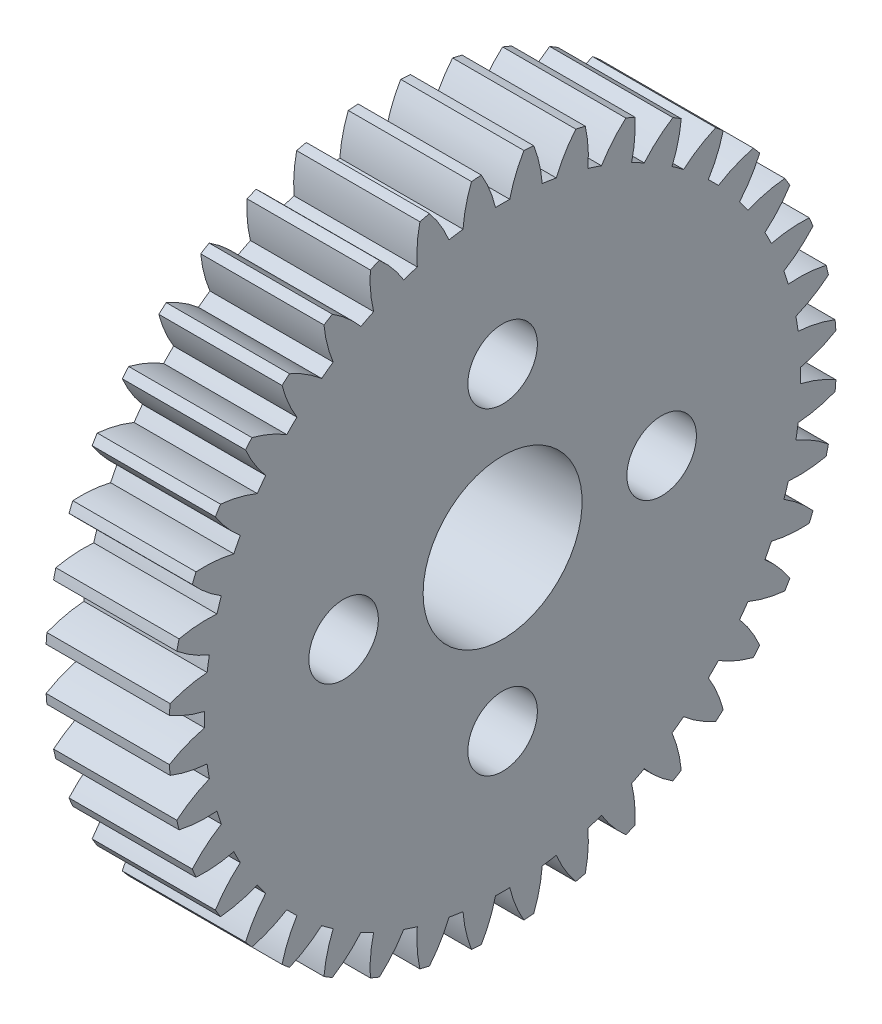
from build123d import *

# Parameters (mm, degrees)
BASPROSKE_W        = 6.2
BASPROSKE_H        = 16.8
TOOTHCUT_DEPTH     = 25.554429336
TEETHCUTS_COUNT    = 40
BORSKE_R           = 4
BORE_DEPTH         = 50.0000508
SKETCH1_R          = 1.75
CUT_EXTRUDE1_DEPTH = 25.50763099


with BuildPart() as part:
    # BasProSke → Base-Revolve (revolve)
    with BuildSketch(Plane(origin=(0, 0, 0), x_dir=(1, 0, 0), z_dir=(0, 1, 0)), mode=Mode.PRIVATE) as base_revolve_sk:
        with Locations((3.1, 8.4)):
            Rectangle(BASPROSKE_W, BASPROSKE_H)
    revolve(base_revolve_sk.sketch.rotate(Axis((-10, 0, 0), (1, 0, 0)), 180), axis=Axis((-10, 0, 0), (1, 0, 0)))

    # TooCutSke → ToothCut (cut, through all)
    with BuildSketch(Plane(origin=(0, 0, 0), x_dir=(0, 0, -1), z_dir=(1, 0, 0))):
        with BuildLine():
            ThreePointArc((0.358234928, 14.994721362), (0, 14.999), (-0.358234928, 14.994721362))
            ThreePointArc((-0.358234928, 14.994721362), (-0.653764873, 15.920217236), (-1.085976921, 16.790316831))
            ThreePointArc((-1.085976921, 16.790316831), (0, 16.8254), (1.085976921, 16.790316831))
            ThreePointArc((1.085976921, 16.790316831), (0.653764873, 15.920217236), (0.358234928, 14.994721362))
        make_face()
    toothcut = extrude(amount=TOOTHCUT_DEPTH, mode=Mode.SUBTRACT)

    # TeethCuts: ToothCut ×40 about axis
    teethcuts_axis = Axis((0, 0, 0), (1, 0, 0))
    for i in range(1, TEETHCUTS_COUNT):
        add(toothcut.rotate(teethcuts_axis, i * 360 / TEETHCUTS_COUNT), mode=Mode.SUBTRACT)

    # BorSke → Bore (cut, symmetric)
    with BuildSketch(Plane(origin=(0, 0, 0), x_dir=(0, 0, -1), z_dir=(1, 0, 0))):
        with Locations(Location((0, 0, 0), (0, 0, 180))):
            Circle(BORSKE_R)
    extrude(amount=BORE_DEPTH, both=True, mode=Mode.SUBTRACT)

    # Sketch1 → Cut-Extrude1 (cut, through all)
    with BuildSketch(Plane(origin=(6.2, 0, 0), x_dir=(0, 0, -1), z_dir=(1, 0, 0))):
        with Locations((0, 8)):
            Circle(SKETCH1_R)
        with Locations((0, -8)):
            Circle(SKETCH1_R)
        with Locations((8, 0)):
            Circle(SKETCH1_R)
        with Locations((-8, 0)):
            Circle(SKETCH1_R)
    extrude(amount=-CUT_EXTRUDE1_DEPTH, mode=Mode.SUBTRACT)


solid = part.part
